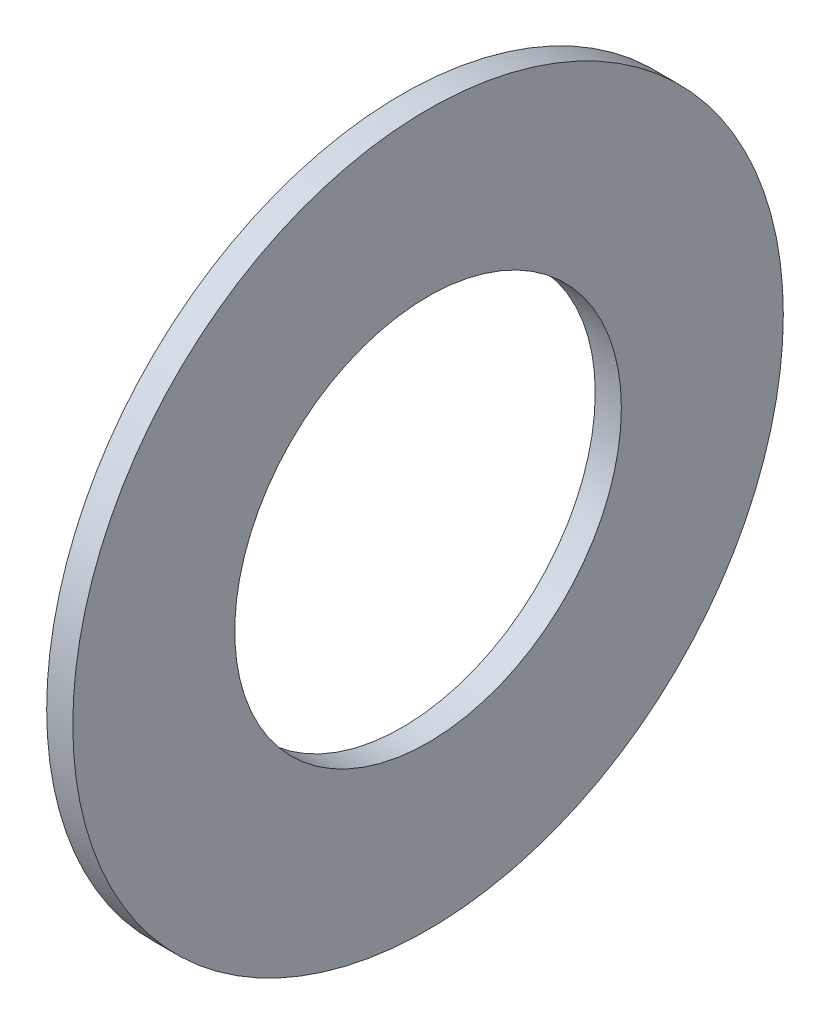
from build123d import *

# Parameters (mm, degrees)
SKETCH1_R          = 34
SKETCH1_R_2        = 18.5
BASE_EXTRUDE_DEPTH = 2.5


with BuildPart() as part:
    # Sketch1 → Base-Extrude (new body)
    with BuildSketch(Plane(origin=(0, 0, 0), x_dir=(0, 0, -1), z_dir=(1, 0, 0))):
        Circle(SKETCH1_R)
        Circle(SKETCH1_R_2, mode=Mode.SUBTRACT)
    extrude(amount=BASE_EXTRUDE_DEPTH)


solid = part.part
